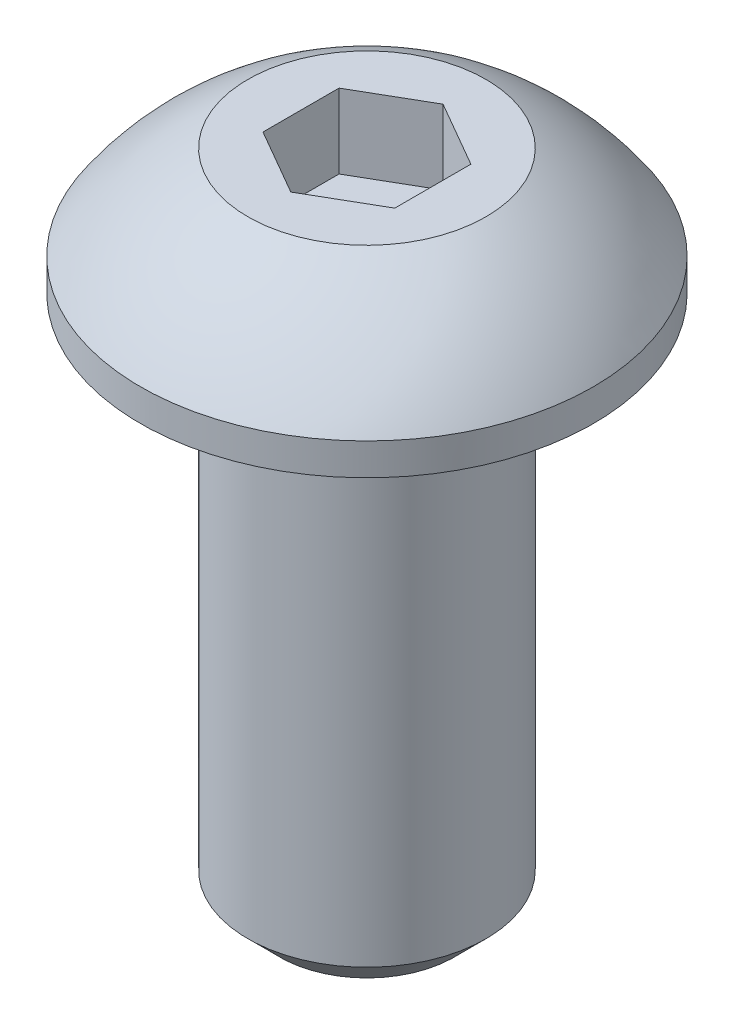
from build123d import *

# Parameters (mm, degrees)
CUT_EXTRUDE1_DEPTH = 0.889


with BuildPart() as part:
    # Sketch1 → Base-Revolve (revolve)
    with BuildSketch(Plane.XY, mode=Mode.PRIVATE) as base_revolve_sk:
        with BuildLine():
            Line((0, 0), (2.7051, 0))
            Line((2.7051, 0), (2.7051, 0.381))
            ThreePointArc((2.7051, 0.381), (2.138064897, 1.025093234), (1.4224, 1.4986))
            Line((1.4224, 1.4986), (0, 1.4986))
            Line((0, 1.4986), (0, 0))
        make_face()
    revolve(base_revolve_sk.sketch.rotate(Axis((0, 0, 0), (0, 1, 0)), 90), axis=Axis((0, 0, 0), (0, 1, 0)))

    # Sketch2 → Boss-Revolve1 (revolve)
    with BuildSketch(Plane.XY, mode=Mode.PRIVATE) as boss_revolve1_sk:
        Polygon((0, -6.35), (1.04394, -6.35), (1.4224, -5.97154), (1.4224, 0), (0, 0), align=None)
    revolve(boss_revolve1_sk.sketch.rotate(Axis((0, 0, 0), (0, 1, 0)), 90), axis=Axis((0, 0, 0), (0, 1, 0)))

    # Sketch3 → Cut-Extrude1 (cut)
    with BuildSketch(Plane(origin=(0, 1.4986, 0), x_dir=(-1, 0, 0), z_dir=(0, 1, 0))):
        Polygon((0.7874, 0.454605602), (0, 0.909211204), (-0.7874, 0.454605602), (-0.7874, -0.454605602), (0, -0.909211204), (0.7874, -0.454605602), align=None)
    extrude(amount=-CUT_EXTRUDE1_DEPTH, mode=Mode.SUBTRACT)


solid = part.part
